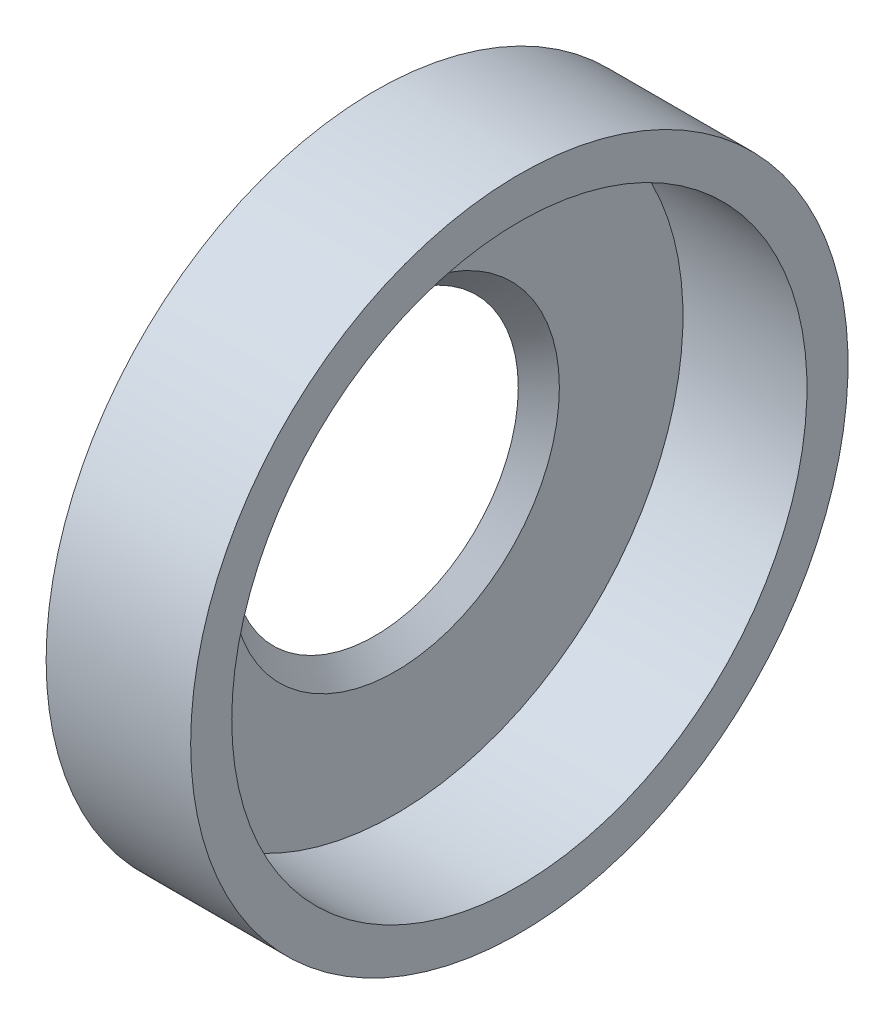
from build123d import *


with BuildPart() as part:
    # Sketch1 → Revolve1 (revolve)
    with BuildSketch(Plane.XY, mode=Mode.PRIVATE) as revolve1_sk:
        Polygon((0, 5.5426), (0, 12.7), (5.5842, 12.7), (5.5842, 11.1125), (0.79375, 11.1125), (0.79375, 6.33635), align=None)
    revolve(revolve1_sk.sketch.rotate(Axis((0, 0, 0), (1, 0, 0)), 90), axis=Axis((0, 0, 0), (1, 0, 0)))


solid = part.part
